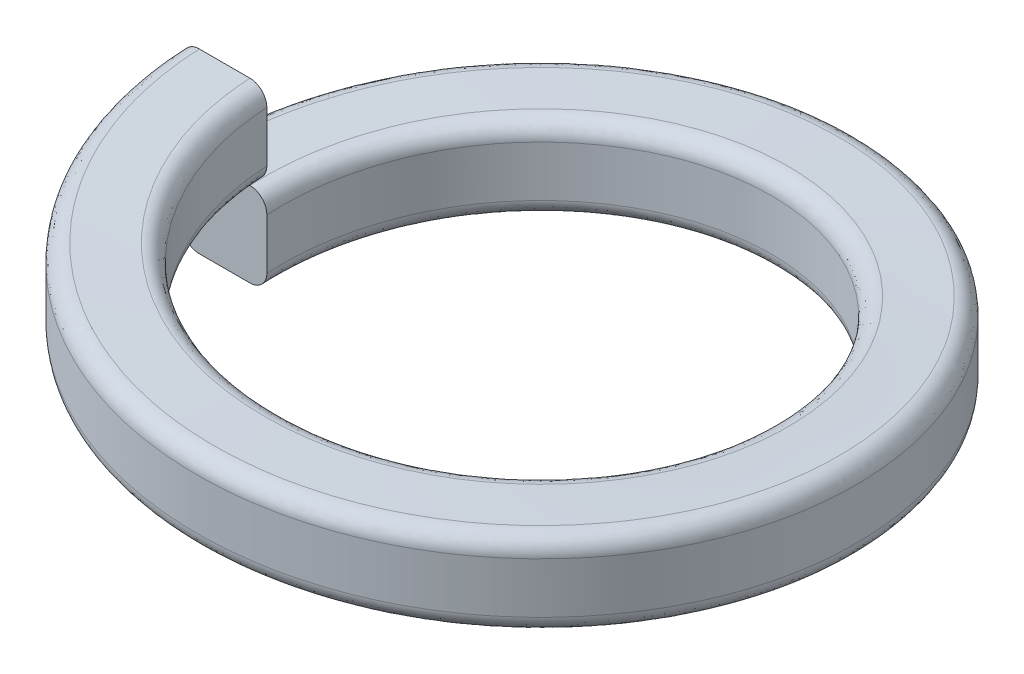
from build123d import *

# Parameters (mm, degrees)
SWEEP_7_PITCH       = 1.1
SWEEP_7_HEIGHT      = 1.1
SWEEP_7_RADIUS      = 3.5
SWEEP_7_START_ANGLE = -90
SKETCH_9_W          = 1
SKETCH_9_H          = 1
FILLET_1_R          = 0.2
FILLET_2_R          = 0.2


with BuildPart() as part:
    # Sweep 7: sweep along a helix
    with BuildLine() as sweep_7_path:
        add(Helix(SWEEP_7_PITCH, SWEEP_7_HEIGHT, SWEEP_7_RADIUS, center=(0, 0, 0), direction=(0, 1, 0), lefthand=True, mode=Mode.PRIVATE).rotate(Axis((0, 0, 0), (0, 1, 0)), SWEEP_7_START_ANGLE))
    # Sketch 9 → Sweep 7 (sweep)
    with BuildSketch(Plane.XY):
        with Locations((-3.402610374, 1.058706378)):
            Rectangle(SKETCH_9_W, SKETCH_9_H)
    sweep(path=sweep_7_path.line, is_frenet=True)

    # Fillet 1
    fillet_1_edges = [part.edges().sort_by_distance(p)[0] for p in [
        (2.902607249, 1.008706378, 0),
        (3.902606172, 1.008706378, 0),
    ]]
    fillet(fillet_1_edges, radius=FILLET_1_R)

    # Fillet 2
    fillet_2_edges = [part.edges().sort_by_distance(p)[0] for p in [
        (2.902607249, 0.008706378, 0),
        (3.902606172, 0.008706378, 0),
    ]]
    fillet(fillet_2_edges, radius=FILLET_2_R)


solid = part.part
